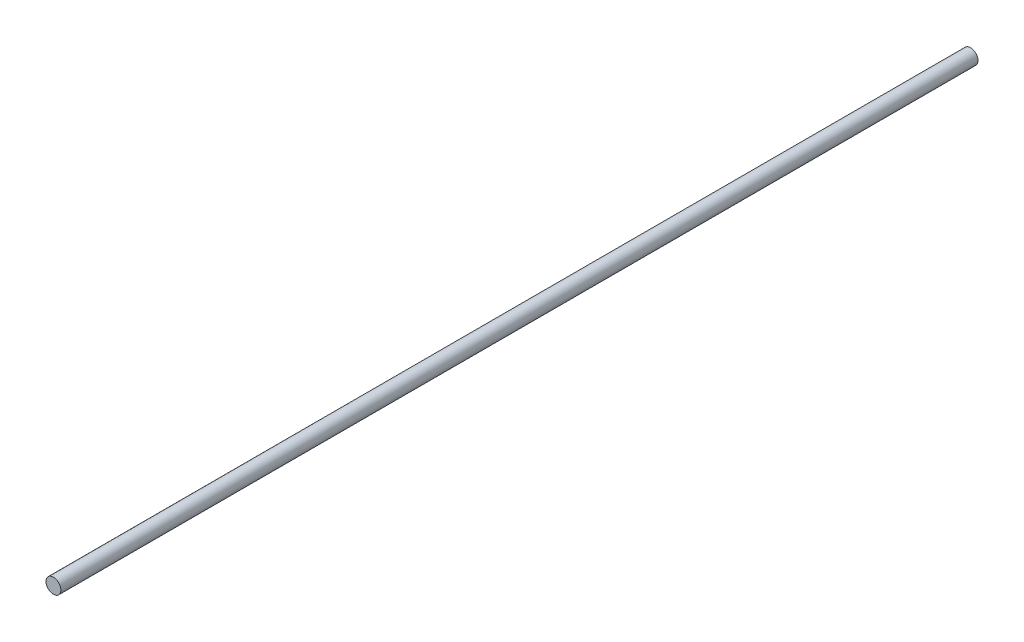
ISO-10303-21;
HEADER;
FILE_DESCRIPTION(('STEP AP214'),'2;1');
FILE_NAME('part.step','',(''),(''),'','','');
FILE_SCHEMA(('AUTOMOTIVE_DESIGN { 1 0 10303 214 1 1 1 1 }'));
ENDSEC;
DATA;
#1=APPLICATION_CONTEXT('core data for automotive mechanical design processes');
#2=APPLICATION_PROTOCOL_DEFINITION('international standard','automotive_design',2000,#1);
#3=PRODUCT_CONTEXT('',#1,'mechanical');
#4=PRODUCT('Part','Part','',(#3));
#5=PRODUCT_RELATED_PRODUCT_CATEGORY('part','',(#4));
#6=PRODUCT_DEFINITION_FORMATION('','',#4);
#7=PRODUCT_DEFINITION_CONTEXT('part definition',#1,'design');
#8=PRODUCT_DEFINITION('design','',#6,#7);
#9=PRODUCT_DEFINITION_SHAPE('','',#8);
#10=(LENGTH_UNIT() NAMED_UNIT(*) SI_UNIT(.MILLI.,.METRE.));
#11=(NAMED_UNIT(*) PLANE_ANGLE_UNIT() SI_UNIT($,.RADIAN.));
#12=(NAMED_UNIT(*) SI_UNIT($,.STERADIAN.) SOLID_ANGLE_UNIT());
#13=UNCERTAINTY_MEASURE_WITH_UNIT(LENGTH_MEASURE(1.E-05),#10,'distance_accuracy_value','');
#14=(GEOMETRIC_REPRESENTATION_CONTEXT(3) GLOBAL_UNCERTAINTY_ASSIGNED_CONTEXT((#13)) GLOBAL_UNIT_ASSIGNED_CONTEXT((#10,
#11,#12)) REPRESENTATION_CONTEXT('',''));
#15=CARTESIAN_POINT('',(0.,0.,0.));
#16=DIRECTION('',(0.,0.,1.));
#17=DIRECTION('',(1.,0.,0.));
#18=AXIS2_PLACEMENT_3D('',#15,#16,#17);
#19=CARTESIAN_POINT('',(0.,0.,-3700.));
#20=DIRECTION('',(0.,0.,1.));
#21=DIRECTION('',(1.,0.,0.));
#22=AXIS2_PLACEMENT_3D('',#19,#20,#21);
#23=CYLINDRICAL_SURFACE('',#22,30.);
#24=CARTESIAN_POINT('',(0.,0.,-3700.));
#25=DIRECTION('',(0.,0.,1.));
#26=DIRECTION('',(1.,0.,0.));
#27=AXIS2_PLACEMENT_3D('',#24,#25,#26);
#28=CIRCLE('',#27,30.);
#29=CARTESIAN_POINT('',(30.,0.,-3700.));
#30=VERTEX_POINT('',#29);
#31=EDGE_CURVE('E10',#30,#30,#28,.T.);
#32=CARTESIAN_POINT('',(0.,0.,0.));
#33=DIRECTION('',(0.,0.,1.));
#34=DIRECTION('',(1.,0.,0.));
#35=AXIS2_PLACEMENT_3D('',#32,#33,#34);
#36=CIRCLE('',#35,30.);
#37=CARTESIAN_POINT('',(30.,0.,-4.44089209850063E-13));
#38=VERTEX_POINT('',#37);
#39=EDGE_CURVE('E40',#38,#38,#36,.T.);
#40=CARTESIAN_POINT('',(30.,0.,-3700.));
#41=CARTESIAN_POINT('',(30.,0.,-3661.45833333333));
#42=CARTESIAN_POINT('',(30.,0.,-3622.91666666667));
#43=CARTESIAN_POINT('',(30.,0.,-3545.83333333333));
#44=CARTESIAN_POINT('',(30.,0.,-3507.29166666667));
#45=CARTESIAN_POINT('',(30.,0.,-3430.20833333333));
#46=CARTESIAN_POINT('',(30.,0.,-3391.66666666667));
#47=CARTESIAN_POINT('',(30.,0.,-3314.58333333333));
#48=CARTESIAN_POINT('',(30.,0.,-3276.04166666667));
#49=CARTESIAN_POINT('',(30.,0.,-3198.95833333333));
#50=CARTESIAN_POINT('',(30.,0.,-3160.41666666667));
#51=CARTESIAN_POINT('',(30.,0.,-3083.33333333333));
#52=CARTESIAN_POINT('',(30.,0.,-3044.79166666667));
#53=CARTESIAN_POINT('',(30.,0.,-2967.70833333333));
#54=CARTESIAN_POINT('',(30.,0.,-2929.16666666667));
#55=CARTESIAN_POINT('',(30.,0.,-2852.08333333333));
#56=CARTESIAN_POINT('',(30.,0.,-2813.54166666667));
#57=CARTESIAN_POINT('',(30.,0.,-2736.45833333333));
#58=CARTESIAN_POINT('',(30.,0.,-2697.91666666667));
#59=CARTESIAN_POINT('',(30.,0.,-2620.83333333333));
#60=CARTESIAN_POINT('',(30.,0.,-2582.29166666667));
#61=CARTESIAN_POINT('',(30.,0.,-2505.20833333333));
#62=CARTESIAN_POINT('',(30.,0.,-2466.66666666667));
#63=CARTESIAN_POINT('',(30.,0.,-2389.58333333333));
#64=CARTESIAN_POINT('',(30.,0.,-2351.04166666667));
#65=CARTESIAN_POINT('',(30.,0.,-2273.95833333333));
#66=CARTESIAN_POINT('',(30.,0.,-2235.41666666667));
#67=CARTESIAN_POINT('',(30.,0.,-2158.33333333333));
#68=CARTESIAN_POINT('',(30.,0.,-2119.79166666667));
#69=CARTESIAN_POINT('',(30.,0.,-2042.70833333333));
#70=CARTESIAN_POINT('',(30.,0.,-2004.16666666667));
#71=CARTESIAN_POINT('',(30.,0.,-1927.08333333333));
#72=CARTESIAN_POINT('',(30.,0.,-1888.54166666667));
#73=CARTESIAN_POINT('',(30.,0.,-1811.45833333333));
#74=CARTESIAN_POINT('',(30.,0.,-1772.91666666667));
#75=CARTESIAN_POINT('',(30.,0.,-1695.83333333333));
#76=CARTESIAN_POINT('',(30.,0.,-1657.29166666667));
#77=CARTESIAN_POINT('',(30.,0.,-1580.20833333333));
#78=CARTESIAN_POINT('',(30.,0.,-1541.66666666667));
#79=CARTESIAN_POINT('',(30.,0.,-1464.58333333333));
#80=CARTESIAN_POINT('',(30.,0.,-1426.04166666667));
#81=CARTESIAN_POINT('',(30.,0.,-1348.95833333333));
#82=CARTESIAN_POINT('',(30.,0.,-1310.41666666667));
#83=CARTESIAN_POINT('',(30.,0.,-1233.33333333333));
#84=CARTESIAN_POINT('',(30.,0.,-1194.79166666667));
#85=CARTESIAN_POINT('',(30.,0.,-1117.70833333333));
#86=CARTESIAN_POINT('',(30.,0.,-1079.16666666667));
#87=CARTESIAN_POINT('',(30.,0.,-1002.08333333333));
#88=CARTESIAN_POINT('',(30.,0.,-963.541666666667));
#89=CARTESIAN_POINT('',(30.,0.,-886.458333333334));
#90=CARTESIAN_POINT('',(30.,0.,-847.916666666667));
#91=CARTESIAN_POINT('',(30.,0.,-770.833333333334));
#92=CARTESIAN_POINT('',(30.,0.,-732.291666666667));
#93=CARTESIAN_POINT('',(30.,0.,-655.208333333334));
#94=CARTESIAN_POINT('',(30.,0.,-616.666666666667));
#95=CARTESIAN_POINT('',(30.,0.,-539.583333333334));
#96=CARTESIAN_POINT('',(30.,0.,-501.041666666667));
#97=CARTESIAN_POINT('',(30.,0.,-423.958333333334));
#98=CARTESIAN_POINT('',(30.,0.,-385.416666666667));
#99=CARTESIAN_POINT('',(30.,0.,-308.333333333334));
#100=CARTESIAN_POINT('',(30.,0.,-269.791666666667));
#101=CARTESIAN_POINT('',(30.,0.,-192.708333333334));
#102=CARTESIAN_POINT('',(30.,0.,-154.166666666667));
#103=CARTESIAN_POINT('',(30.,0.,-77.0833333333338));
#104=CARTESIAN_POINT('',(30.,0.,-38.5416666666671));
#105=CARTESIAN_POINT('',(30.,0.,-4.44089209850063E-13));
#106=B_SPLINE_CURVE_WITH_KNOTS('',3,(#40,#41,#42,#43,#44,#45,#46,#47,#48,#49,#50,#51,#52,#53,
#54,#55,#56,#57,#58,#59,#60,#61,#62,#63,#64,#65,#66,#67,#68,#69,#70,#71,#72,#73,#74,#75,#76,#77,
#78,#79,#80,#81,#82,#83,#84,#85,#86,#87,#88,#89,#90,#91,#92,#93,#94,#95,#96,#97,#98,#99,#100,
#101,#102,#103,#104,#105),.UNSPECIFIED.,.F.,.F.,(4,2,2,2,2,2,2,2,2,2,2,2,2,2,2,2,2,2,2,2,2,2,2,
2,2,2,2,2,2,2,2,2,4),(0.,115.625,231.25,346.875,462.5,578.125,693.75,809.375,925.,1040.625,
1156.25,1271.875,1387.5,1503.125,1618.75,1734.375,1850.,1965.625,2081.25,2196.875,2312.5,
2428.125,2543.75,2659.375,2775.,2890.625,3006.25,3121.875,3237.5,3353.125,3468.75,3584.375,
3700.),.UNSPECIFIED.);
#107=EDGE_CURVE('BSEAM37',#30,#38,#106,.T.);
#108=ORIENTED_EDGE('',*,*,#31,.T.);
#109=ORIENTED_EDGE('',*,*,#39,.F.);
#110=ORIENTED_EDGE('',*,*,#107,.T.);
#111=ORIENTED_EDGE('',*,*,#107,.F.);
#112=EDGE_LOOP('',(#108,#110,#109,#111));
#113=FACE_BOUND('',#112,.T.);
#114=ADVANCED_FACE('F37',(#113),#23,.T.);
#115=CARTESIAN_POINT('',(0.,0.,-3700.));
#116=DIRECTION('',(0.,0.,1.));
#117=DIRECTION('',(1.,0.,0.));
#118=AXIS2_PLACEMENT_3D('',#115,#116,#117);
#119=PLANE('',#118);
#120=ORIENTED_EDGE('',*,*,#31,.F.);
#121=EDGE_LOOP('',(#120));
#122=FACE_BOUND('',#121,.T.);
#123=ADVANCED_FACE('F54',(#122),#119,.F.);
#124=CARTESIAN_POINT('',(0.,0.,0.));
#125=DIRECTION('',(0.,0.,1.));
#126=DIRECTION('',(1.,0.,0.));
#127=AXIS2_PLACEMENT_3D('',#124,#125,#126);
#128=PLANE('',#127);
#129=ORIENTED_EDGE('',*,*,#39,.T.);
#130=EDGE_LOOP('',(#129));
#131=FACE_BOUND('',#130,.T.);
#132=ADVANCED_FACE('F51',(#131),#128,.T.);
#133=CLOSED_SHELL('',(#114,#123,#132));
#134=MANIFOLD_SOLID_BREP('B2',#133);
#135=ADVANCED_BREP_SHAPE_REPRESENTATION('',(#18,#134),#14);
#136=SHAPE_DEFINITION_REPRESENTATION(#9,#135);
ENDSEC;
END-ISO-10303-21;
